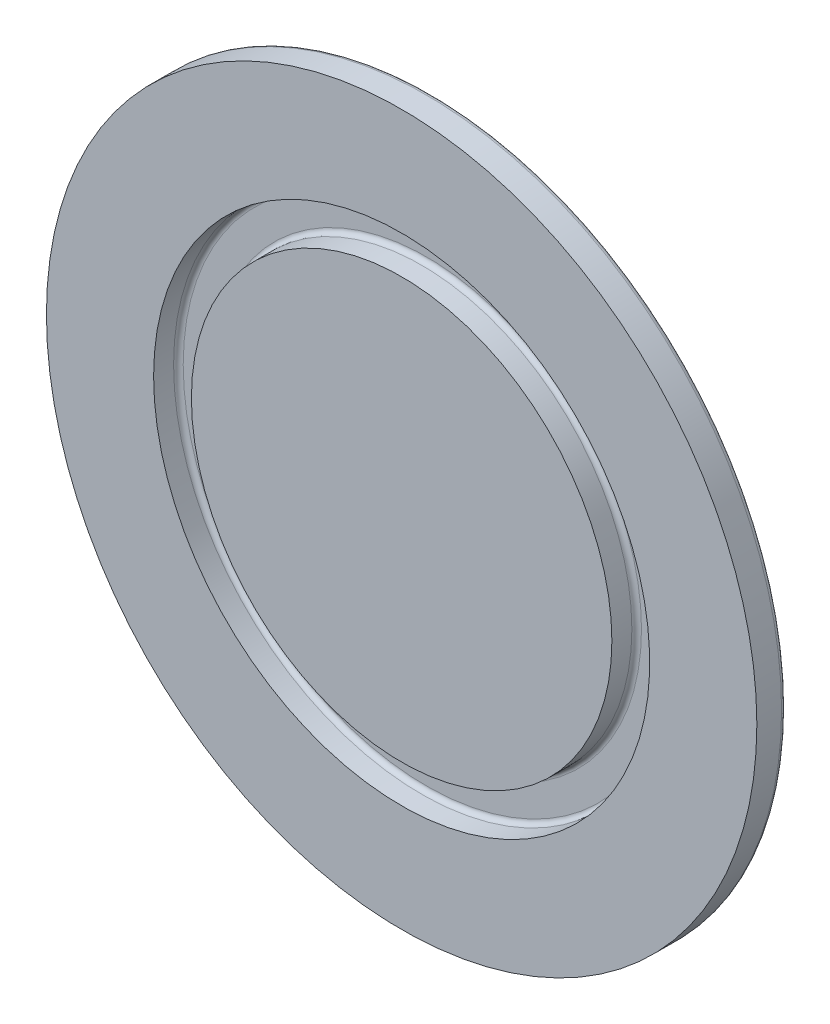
from build123d import *


with BuildPart() as part:
    # Sketch2 → Revolve1 (revolve)
    with BuildSketch(Plane(origin=(0, 0, 0), x_dir=(0, 0, -1), z_dir=(1, 0, 0)), mode=Mode.PRIVATE) as revolve1_sk:
        with BuildLine():
            Line((2.54, 29.691884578), (2.54, 0))
            Line((2.54, 0), (-2.54, 0))
            Line((-2.54, 0), (-2.54, 22.1742))
            Line((-2.54, 22.1742), (-0.4318, 22.1742))
            ThreePointArc((-0.4318, 22.1742), (-0.072589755, 22.322989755), (0.0762, 22.6822))
            Line((0.0762, 22.6822), (0.0762, 25.654))
            ThreePointArc((0.0762, 25.654), (-0.072589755, 26.013210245), (-0.4318, 26.162))
            Line((-0.4318, 26.162), (-2.54, 26.162))
            Line((-2.54, 26.162), (-2.54, 37.465))
            Line((-2.54, 37.465), (0.06739789, 37.465))
            ThreePointArc((0.06739789, 37.465), (0.376648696, 37.360023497), (0.55808821, 37.088480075))
            Line((0.55808821, 37.088480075), (2.54, 29.691884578))
        make_face()
    revolve(revolve1_sk.sketch.rotate(Axis((0, 0, -2.54), (0, 0, 1)), 90), axis=Axis((0, 0, -2.54), (0, 0, 1)))


solid = part.part
